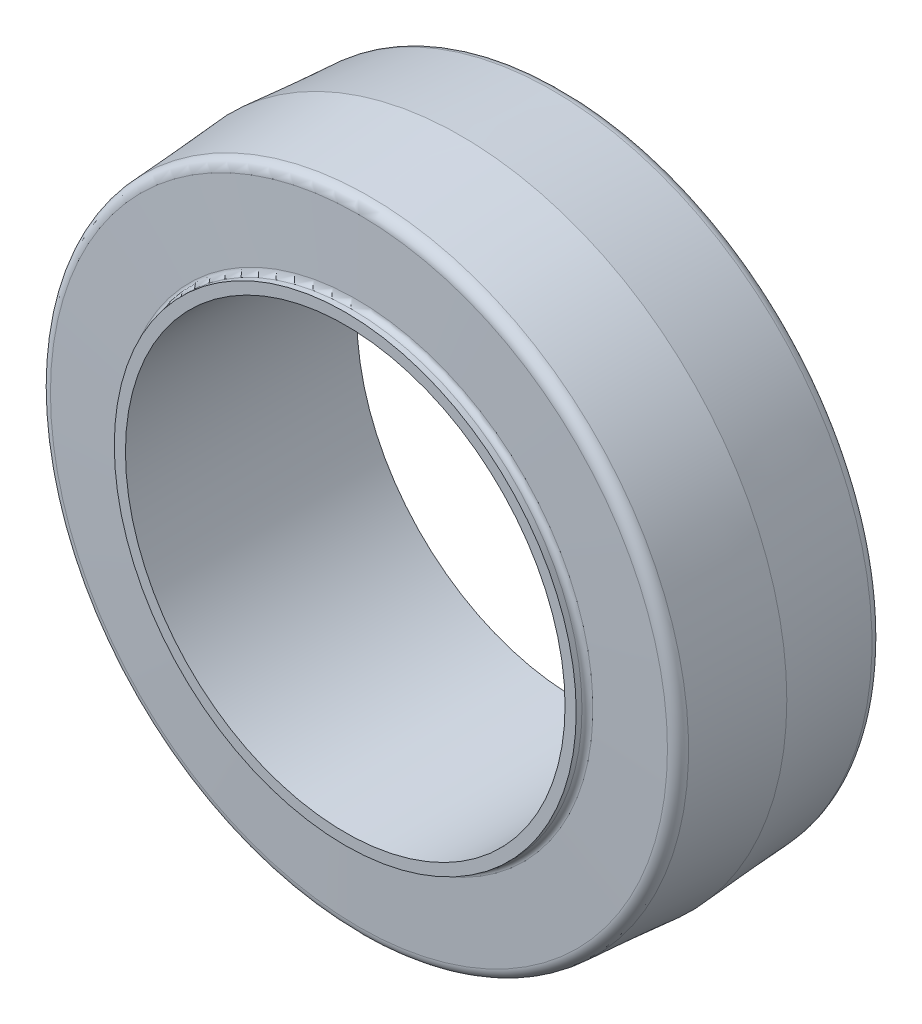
ISO-10303-21;
HEADER;
FILE_DESCRIPTION(('STEP AP214'),'2;1');
FILE_NAME('part.step','',(''),(''),'','','');
FILE_SCHEMA(('AUTOMOTIVE_DESIGN { 1 0 10303 214 1 1 1 1 }'));
ENDSEC;
DATA;
#1=APPLICATION_CONTEXT('core data for automotive mechanical design processes');
#2=APPLICATION_PROTOCOL_DEFINITION('international standard','automotive_design',2000,#1);
#3=PRODUCT_CONTEXT('',#1,'mechanical');
#4=PRODUCT('Part','Part','',(#3));
#5=PRODUCT_RELATED_PRODUCT_CATEGORY('part','',(#4));
#6=PRODUCT_DEFINITION_FORMATION('','',#4);
#7=PRODUCT_DEFINITION_CONTEXT('part definition',#1,'design');
#8=PRODUCT_DEFINITION('design','',#6,#7);
#9=PRODUCT_DEFINITION_SHAPE('','',#8);
#10=(LENGTH_UNIT() NAMED_UNIT(*) SI_UNIT(.MILLI.,.METRE.));
#11=(NAMED_UNIT(*) PLANE_ANGLE_UNIT() SI_UNIT($,.RADIAN.));
#12=(NAMED_UNIT(*) SI_UNIT($,.STERADIAN.) SOLID_ANGLE_UNIT());
#13=UNCERTAINTY_MEASURE_WITH_UNIT(LENGTH_MEASURE(1.E-05),#10,'distance_accuracy_value','');
#14=(GEOMETRIC_REPRESENTATION_CONTEXT(3) GLOBAL_UNCERTAINTY_ASSIGNED_CONTEXT((#13)) GLOBAL_UNIT_ASSIGNED_CONTEXT((#10,
#11,#12)) REPRESENTATION_CONTEXT('',''));
#15=CARTESIAN_POINT('',(0.,0.,0.));
#16=DIRECTION('',(0.,0.,1.));
#17=DIRECTION('',(1.,0.,0.));
#18=AXIS2_PLACEMENT_3D('',#15,#16,#17);
#19=CARTESIAN_POINT('',(0.,0.,0.));
#20=DIRECTION('',(0.,0.,-1.));
#21=DIRECTION('',(-1.,0.,0.));
#22=AXIS2_PLACEMENT_3D('',#19,#20,#21);
#23=CONICAL_SURFACE('',#22,44.5008,0.0712094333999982);
#24=CARTESIAN_POINT('',(0.,0.,7.27196081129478E-11));
#25=DIRECTION('',(0.,0.,1.));
#26=DIRECTION('',(1.,0.,0.));
#27=AXIS2_PLACEMENT_3D('',#24,#25,#26);
#28=CIRCLE('',#27,44.5007999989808);
#29=CARTESIAN_POINT('',(44.5007999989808,0.,7.27248122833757E-11));
#30=VERTEX_POINT('',#29);
#31=EDGE_CURVE('E108',#30,#30,#28,.F.);
#32=ORIENTED_EDGE('',*,*,#31,.F.);
#33=EDGE_LOOP('',(#32));
#34=FACE_BOUND('',#33,.T.);
#35=CARTESIAN_POINT('',(0.,0.,12.5251314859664));
#36=DIRECTION('',(0.,0.,-1.));
#37=DIRECTION('',(-1.,0.,0.));
#38=AXIS2_PLACEMENT_3D('',#35,#36,#37);
#39=CIRCLE('',#38,43.6073818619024);
#40=CARTESIAN_POINT('',(-43.6073818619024,0.,12.5251314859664));
#41=VERTEX_POINT('',#40);
#42=EDGE_CURVE('E105',#41,#41,#39,.F.);
#43=ORIENTED_EDGE('',*,*,#42,.F.);
#44=EDGE_LOOP('',(#43));
#45=FACE_BOUND('',#44,.T.);
#46=ADVANCED_FACE('F14',(#34,#45),#23,.T.);
#47=CARTESIAN_POINT('',(0.,0.,7.27716498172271E-11));
#48=DIRECTION('',(0.,0.,1.));
#49=DIRECTION('',(1.,0.,0.));
#50=AXIS2_PLACEMENT_3D('',#47,#48,#49);
#51=CONICAL_SURFACE('',#50,44.5007999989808,0.0712094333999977);
#52=ORIENTED_EDGE('',*,*,#31,.T.);
#53=EDGE_LOOP('',(#52));
#54=FACE_BOUND('',#53,.T.);
#55=CARTESIAN_POINT('',(0.,0.,-12.5251314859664));
#56=DIRECTION('',(0.,0.,-1.));
#57=DIRECTION('',(-1.,0.,0.));
#58=AXIS2_PLACEMENT_3D('',#55,#56,#57);
#59=CIRCLE('',#58,43.6073818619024);
#60=CARTESIAN_POINT('',(-43.6073818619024,0.,-12.5251314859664));
#61=VERTEX_POINT('',#60);
#62=EDGE_CURVE('E85',#61,#61,#59,.T.);
#63=ORIENTED_EDGE('',*,*,#62,.F.);
#64=EDGE_LOOP('',(#63));
#65=FACE_BOUND('',#64,.T.);
#66=ADVANCED_FACE('F100',(#54,#65),#51,.T.);
#67=CARTESIAN_POINT('',(0.,0.,12.416700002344));
#68=DIRECTION('',(0.,0.,-1.));
#69=DIRECTION('',(-1.,0.,0.));
#70=AXIS2_PLACEMENT_3D('',#67,#68,#69);
#71=TOROIDAL_SURFACE('',#70,42.0872441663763,1.524);
#72=ORIENTED_EDGE('',*,*,#42,.T.);
#73=EDGE_LOOP('',(#72));
#74=FACE_BOUND('',#73,.T.);
#75=CARTESIAN_POINT('',(0.,0.,13.9398796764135));
#76=DIRECTION('',(0.,0.,-1.));
#77=DIRECTION('',(-1.,0.,0.));
#78=AXIS2_PLACEMENT_3D('',#75,#76,#77);
#79=CIRCLE('',#78,42.1372409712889);
#80=CARTESIAN_POINT('',(-42.1372409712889,0.,13.9398796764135));
#81=VERTEX_POINT('',#80);
#82=EDGE_CURVE('E80',#81,#81,#79,.F.);
#83=ORIENTED_EDGE('',*,*,#82,.F.);
#84=EDGE_LOOP('',(#83));
#85=FACE_BOUND('',#84,.T.);
#86=ADVANCED_FACE('F96',(#74,#85),#71,.T.);
#87=CARTESIAN_POINT('',(0.,0.,-12.416700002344));
#88=DIRECTION('',(0.,0.,-1.));
#89=DIRECTION('',(-1.,0.,0.));
#90=AXIS2_PLACEMENT_3D('',#87,#88,#89);
#91=TOROIDAL_SURFACE('',#90,42.0872441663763,1.524);
#92=CARTESIAN_POINT('',(0.,0.,-13.939879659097));
#93=DIRECTION('',(0.,0.,1.));
#94=DIRECTION('',(1.,0.,0.));
#95=AXIS2_PLACEMENT_3D('',#92,#93,#94);
#96=CIRCLE('',#95,42.1372409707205);
#97=CARTESIAN_POINT('',(42.1372409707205,0.,-13.939879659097));
#98=VERTEX_POINT('',#97);
#99=EDGE_CURVE('E75',#98,#98,#96,.F.);
#100=ORIENTED_EDGE('',*,*,#99,.F.);
#101=EDGE_LOOP('',(#100));
#102=FACE_BOUND('',#101,.T.);
#103=ORIENTED_EDGE('',*,*,#62,.T.);
#104=EDGE_LOOP('',(#103));
#105=FACE_BOUND('',#104,.T.);
#106=ADVANCED_FACE('F92',(#102,#105),#91,.T.);
#107=CARTESIAN_POINT('',(0.,0.,13.9398796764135));
#108=DIRECTION('',(0.,0.,-1.));
#109=DIRECTION('',(-1.,0.,0.));
#110=AXIS2_PLACEMENT_3D('',#107,#108,#109);
#111=CONICAL_SURFACE('',#110,42.1372409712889,1.53798413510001);
#112=ORIENTED_EDGE('',*,*,#82,.T.);
#113=EDGE_LOOP('',(#112));
#114=FACE_BOUND('',#113,.T.);
#115=CARTESIAN_POINT('',(0.,0.,14.263308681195));
#116=DIRECTION('',(0.,0.,-1.));
#117=DIRECTION('',(-1.,0.,0.));
#118=AXIS2_PLACEMENT_3D('',#115,#116,#117);
#119=CIRCLE('',#118,32.2838015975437);
#120=CARTESIAN_POINT('',(-32.2838015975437,0.,14.263308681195));
#121=VERTEX_POINT('',#120);
#122=EDGE_CURVE('E72',#121,#121,#119,.T.);
#123=ORIENTED_EDGE('',*,*,#122,.T.);
#124=EDGE_LOOP('',(#123));
#125=FACE_BOUND('',#124,.T.);
#126=ADVANCED_FACE('F95',(#114,#125),#111,.T.);
#127=CARTESIAN_POINT('',(0.,0.,-13.939879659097));
#128=DIRECTION('',(0.,0.,1.));
#129=DIRECTION('',(1.,0.,0.));
#130=AXIS2_PLACEMENT_3D('',#127,#128,#129);
#131=CONICAL_SURFACE('',#130,42.1372409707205,1.5379841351);
#132=ORIENTED_EDGE('',*,*,#99,.T.);
#133=EDGE_LOOP('',(#132));
#134=FACE_BOUND('',#133,.T.);
#135=CARTESIAN_POINT('',(0.,0.,-14.263308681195));
#136=DIRECTION('',(0.,0.,-1.));
#137=DIRECTION('',(-1.,0.,0.));
#138=AXIS2_PLACEMENT_3D('',#135,#136,#137);
#139=CIRCLE('',#138,32.2838015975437);
#140=CARTESIAN_POINT('',(-32.2838015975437,0.,-14.263308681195));
#141=VERTEX_POINT('',#140);
#142=EDGE_CURVE('E44',#141,#141,#139,.F.);
#143=ORIENTED_EDGE('',*,*,#142,.T.);
#144=EDGE_LOOP('',(#143));
#145=FACE_BOUND('',#144,.T.);
#146=ADVANCED_FACE('F66',(#134,#145),#131,.T.);
#147=CARTESIAN_POINT('',(0.,0.,15.0248985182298));
#148=DIRECTION('',(0.,0.,-1.));
#149=DIRECTION('',(-1.,0.,0.));
#150=AXIS2_PLACEMENT_3D('',#147,#148,#149);
#151=TOROIDAL_SURFACE('',#150,32.3088,0.762);
#152=CARTESIAN_POINT('',(0.,0.,15.0248985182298));
#153=DIRECTION('',(0.,0.,-1.));
#154=DIRECTION('',(-1.,0.,0.));
#155=AXIS2_PLACEMENT_3D('',#152,#153,#154);
#156=CIRCLE('',#155,31.5468);
#157=CARTESIAN_POINT('',(-31.5468,0.,15.0248985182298));
#158=VERTEX_POINT('',#157);
#159=EDGE_CURVE('E39',#158,#158,#156,.F.);
#160=ORIENTED_EDGE('',*,*,#159,.F.);
#161=EDGE_LOOP('',(#160));
#162=FACE_BOUND('',#161,.T.);
#163=ORIENTED_EDGE('',*,*,#122,.F.);
#164=EDGE_LOOP('',(#163));
#165=FACE_BOUND('',#164,.T.);
#166=ADVANCED_FACE('F60',(#162,#165),#151,.F.);
#167=CARTESIAN_POINT('',(0.,0.,-15.0248985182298));
#168=DIRECTION('',(0.,0.,-1.));
#169=DIRECTION('',(-1.,0.,0.));
#170=AXIS2_PLACEMENT_3D('',#167,#168,#169);
#171=TOROIDAL_SURFACE('',#170,32.3088,0.762);
#172=ORIENTED_EDGE('',*,*,#142,.F.);
#173=EDGE_LOOP('',(#172));
#174=FACE_BOUND('',#173,.T.);
#175=CARTESIAN_POINT('',(0.,0.,-15.0248985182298));
#176=DIRECTION('',(0.,0.,-1.));
#177=DIRECTION('',(-1.,0.,0.));
#178=AXIS2_PLACEMENT_3D('',#175,#176,#177);
#179=CIRCLE('',#178,31.5468);
#180=CARTESIAN_POINT('',(-31.5468,0.,-15.0248985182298));
#181=VERTEX_POINT('',#180);
#182=EDGE_CURVE('E35',#181,#181,#179,.T.);
#183=ORIENTED_EDGE('',*,*,#182,.F.);
#184=EDGE_LOOP('',(#183));
#185=FACE_BOUND('',#184,.T.);
#186=ADVANCED_FACE('F55',(#174,#185),#171,.F.);
#187=CARTESIAN_POINT('',(0.,0.,0.));
#188=DIRECTION('',(0.,0.,-1.));
#189=DIRECTION('',(-1.,0.,0.));
#190=AXIS2_PLACEMENT_3D('',#187,#188,#189);
#191=CYLINDRICAL_SURFACE('',#190,31.5468);
#192=ORIENTED_EDGE('',*,*,#159,.T.);
#193=EDGE_LOOP('',(#192));
#194=FACE_BOUND('',#193,.T.);
#195=CARTESIAN_POINT('',(0.,0.,15.8115));
#196=DIRECTION('',(0.,0.,-1.));
#197=DIRECTION('',(-1.,0.,0.));
#198=AXIS2_PLACEMENT_3D('',#195,#196,#197);
#199=CIRCLE('',#198,31.5468);
#200=CARTESIAN_POINT('',(-31.5468,0.,15.8115));
#201=VERTEX_POINT('',#200);
#202=EDGE_CURVE('E17',#201,#201,#199,.F.);
#203=ORIENTED_EDGE('',*,*,#202,.F.);
#204=EDGE_LOOP('',(#203));
#205=FACE_BOUND('',#204,.T.);
#206=ADVANCED_FACE('F59',(#194,#205),#191,.T.);
#207=CARTESIAN_POINT('',(0.,0.,0.));
#208=DIRECTION('',(0.,0.,-1.));
#209=DIRECTION('',(-1.,0.,0.));
#210=AXIS2_PLACEMENT_3D('',#207,#208,#209);
#211=CYLINDRICAL_SURFACE('',#210,31.5468);
#212=CARTESIAN_POINT('',(0.,0.,-15.8115));
#213=DIRECTION('',(0.,0.,-1.));
#214=DIRECTION('',(-1.,0.,0.));
#215=AXIS2_PLACEMENT_3D('',#212,#213,#214);
#216=CIRCLE('',#215,31.5468);
#217=CARTESIAN_POINT('',(-31.5468,0.,-15.8115));
#218=VERTEX_POINT('',#217);
#219=EDGE_CURVE('E26',#218,#218,#216,.T.);
#220=ORIENTED_EDGE('',*,*,#219,.F.);
#221=EDGE_LOOP('',(#220));
#222=FACE_BOUND('',#221,.T.);
#223=ORIENTED_EDGE('',*,*,#182,.T.);
#224=EDGE_LOOP('',(#223));
#225=FACE_BOUND('',#224,.T.);
#226=ADVANCED_FACE('F143',(#222,#225),#211,.T.);
#227=CARTESIAN_POINT('',(0.,30.0228,15.8115));
#228=DIRECTION('',(0.,0.,1.));
#229=DIRECTION('',(1.,0.,0.));
#230=AXIS2_PLACEMENT_3D('',#227,#228,#229);
#231=PLANE('',#230);
#232=CARTESIAN_POINT('',(0.,0.,15.8115));
#233=DIRECTION('',(0.,0.,-1.));
#234=DIRECTION('',(-1.,0.,0.));
#235=AXIS2_PLACEMENT_3D('',#232,#233,#234);
#236=CIRCLE('',#235,30.0228);
#237=CARTESIAN_POINT('',(-30.0228,0.,15.8115));
#238=VERTEX_POINT('',#237);
#239=EDGE_CURVE('E21',#238,#238,#236,.T.);
#240=ORIENTED_EDGE('',*,*,#239,.T.);
#241=EDGE_LOOP('',(#240));
#242=FACE_BOUND('',#241,.T.);
#243=ORIENTED_EDGE('',*,*,#202,.T.);
#244=EDGE_LOOP('',(#243));
#245=FACE_BOUND('',#244,.T.);
#246=ADVANCED_FACE('F138',(#242,#245),#231,.T.);
#247=CARTESIAN_POINT('',(0.,30.0228,-15.8115));
#248=DIRECTION('',(0.,0.,-1.));
#249=DIRECTION('',(-1.,0.,0.));
#250=AXIS2_PLACEMENT_3D('',#247,#248,#249);
#251=PLANE('',#250);
#252=CARTESIAN_POINT('',(0.,0.,-15.8115));
#253=DIRECTION('',(0.,0.,-1.));
#254=DIRECTION('',(-1.,0.,0.));
#255=AXIS2_PLACEMENT_3D('',#252,#253,#254);
#256=CIRCLE('',#255,30.0228);
#257=CARTESIAN_POINT('',(-30.0228,0.,-15.8115));
#258=VERTEX_POINT('',#257);
#259=EDGE_CURVE('E10',#258,#258,#256,.F.);
#260=ORIENTED_EDGE('',*,*,#259,.T.);
#261=EDGE_LOOP('',(#260));
#262=FACE_BOUND('',#261,.T.);
#263=ORIENTED_EDGE('',*,*,#219,.T.);
#264=EDGE_LOOP('',(#263));
#265=FACE_BOUND('',#264,.T.);
#266=ADVANCED_FACE('F132',(#262,#265),#251,.T.);
#267=CARTESIAN_POINT('',(0.,0.,0.));
#268=DIRECTION('',(0.,0.,-1.));
#269=DIRECTION('',(-1.,0.,0.));
#270=AXIS2_PLACEMENT_3D('',#267,#268,#269);
#271=CYLINDRICAL_SURFACE('',#270,30.0228);
#272=ORIENTED_EDGE('',*,*,#259,.F.);
#273=EDGE_LOOP('',(#272));
#274=FACE_BOUND('',#273,.T.);
#275=ORIENTED_EDGE('',*,*,#239,.F.);
#276=EDGE_LOOP('',(#275));
#277=FACE_BOUND('',#276,.T.);
#278=ADVANCED_FACE('F130',(#274,#277),#271,.F.);
#279=CLOSED_SHELL('',(#46,#66,#86,#106,#126,#146,#166,#186,#206,#226,#246,#266,#278));
#280=MANIFOLD_SOLID_BREP('B1',#279);
#281=ADVANCED_BREP_SHAPE_REPRESENTATION('',(#18,#280),#14);
#282=SHAPE_DEFINITION_REPRESENTATION(#9,#281);
ENDSEC;
END-ISO-10303-21;
